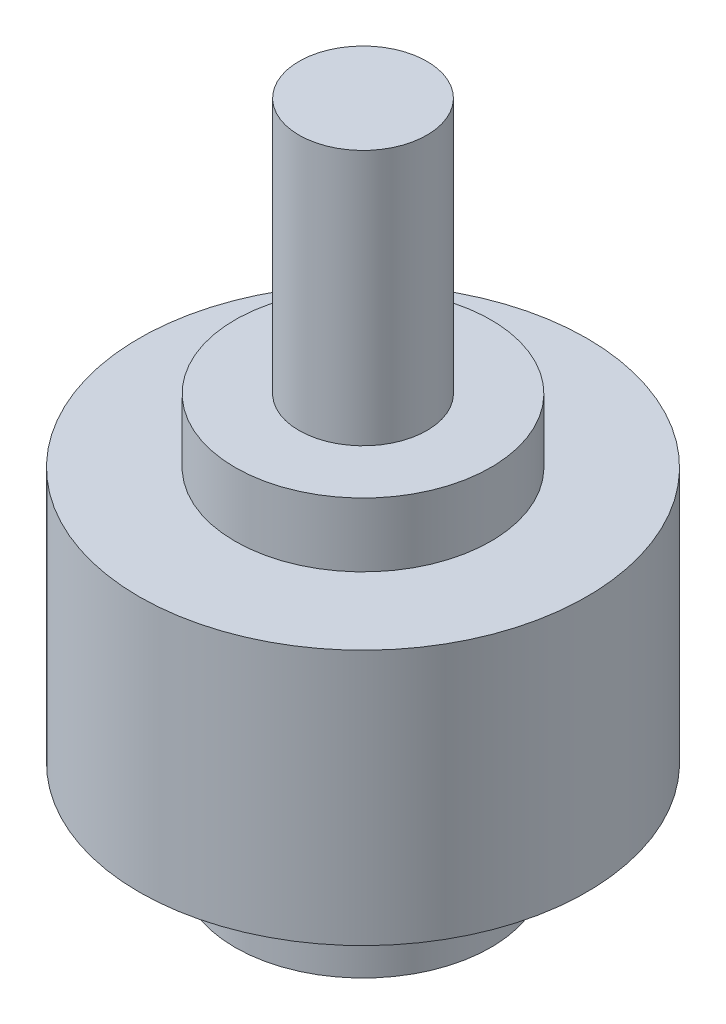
ISO-10303-21;
HEADER;
FILE_DESCRIPTION(('STEP AP214'),'2;1');
FILE_NAME('part.step','',(''),(''),'','','');
FILE_SCHEMA(('AUTOMOTIVE_DESIGN { 1 0 10303 214 1 1 1 1 }'));
ENDSEC;
DATA;
#1=APPLICATION_CONTEXT('core data for automotive mechanical design processes');
#2=APPLICATION_PROTOCOL_DEFINITION('international standard','automotive_design',2000,#1);
#3=PRODUCT_CONTEXT('',#1,'mechanical');
#4=PRODUCT('Part','Part','',(#3));
#5=PRODUCT_RELATED_PRODUCT_CATEGORY('part','',(#4));
#6=PRODUCT_DEFINITION_FORMATION('','',#4);
#7=PRODUCT_DEFINITION_CONTEXT('part definition',#1,'design');
#8=PRODUCT_DEFINITION('design','',#6,#7);
#9=PRODUCT_DEFINITION_SHAPE('','',#8);
#10=(LENGTH_UNIT() NAMED_UNIT(*) SI_UNIT(.MILLI.,.METRE.));
#11=(NAMED_UNIT(*) PLANE_ANGLE_UNIT() SI_UNIT($,.RADIAN.));
#12=(NAMED_UNIT(*) SI_UNIT($,.STERADIAN.) SOLID_ANGLE_UNIT());
#13=UNCERTAINTY_MEASURE_WITH_UNIT(LENGTH_MEASURE(1.E-05),#10,'distance_accuracy_value','');
#14=(GEOMETRIC_REPRESENTATION_CONTEXT(3) GLOBAL_UNCERTAINTY_ASSIGNED_CONTEXT((#13)) GLOBAL_UNIT_ASSIGNED_CONTEXT((#10,
#11,#12)) REPRESENTATION_CONTEXT('',''));
#15=CARTESIAN_POINT('',(0.,0.,0.));
#16=DIRECTION('',(0.,0.,1.));
#17=DIRECTION('',(1.,0.,0.));
#18=AXIS2_PLACEMENT_3D('',#15,#16,#17);
#19=CARTESIAN_POINT('',(12.7,133.35,0.));
#20=DIRECTION('',(0.,-1.,0.));
#21=DIRECTION('',(0.,0.,-1.));
#22=AXIS2_PLACEMENT_3D('',#19,#20,#21);
#23=PLANE('',#22);
#24=CARTESIAN_POINT('',(0.,133.35,0.));
#25=DIRECTION('',(0.,1.,0.));
#26=DIRECTION('',(0.,0.,1.));
#27=AXIS2_PLACEMENT_3D('',#24,#25,#26);
#28=CIRCLE('',#27,12.7);
#29=CARTESIAN_POINT('',(0.,133.35,12.7));
#30=VERTEX_POINT('',#29);
#31=EDGE_CURVE('E10',#30,#30,#28,.T.);
#32=ORIENTED_EDGE('',*,*,#31,.T.);
#33=EDGE_LOOP('',(#32));
#34=FACE_BOUND('',#33,.T.);
#35=ADVANCED_FACE('F30',(#34),#23,.F.);
#36=CARTESIAN_POINT('',(0.,0.,0.));
#37=DIRECTION('',(0.,1.,0.));
#38=DIRECTION('',(0.,0.,1.));
#39=AXIS2_PLACEMENT_3D('',#36,#37,#38);
#40=CYLINDRICAL_SURFACE('',#39,12.7);
#41=ORIENTED_EDGE('',*,*,#31,.F.);
#42=EDGE_LOOP('',(#41));
#43=FACE_BOUND('',#42,.T.);
#44=CARTESIAN_POINT('',(0.,82.55,0.));
#45=DIRECTION('',(0.,1.,0.));
#46=DIRECTION('',(0.,0.,1.));
#47=AXIS2_PLACEMENT_3D('',#44,#45,#46);
#48=CIRCLE('',#47,12.7);
#49=CARTESIAN_POINT('',(0.,82.55,12.7));
#50=VERTEX_POINT('',#49);
#51=EDGE_CURVE('E36',#50,#50,#48,.T.);
#52=ORIENTED_EDGE('',*,*,#51,.T.);
#53=EDGE_LOOP('',(#52));
#54=FACE_BOUND('',#53,.T.);
#55=ADVANCED_FACE('F95',(#43,#54),#40,.T.);
#56=CARTESIAN_POINT('',(25.4,82.55,0.));
#57=DIRECTION('',(0.,-1.,0.));
#58=DIRECTION('',(0.,0.,-1.));
#59=AXIS2_PLACEMENT_3D('',#56,#57,#58);
#60=PLANE('',#59);
#61=ORIENTED_EDGE('',*,*,#51,.F.);
#62=EDGE_LOOP('',(#61));
#63=FACE_BOUND('',#62,.T.);
#64=CARTESIAN_POINT('',(0.,82.55,0.));
#65=DIRECTION('',(0.,1.,0.));
#66=DIRECTION('',(0.,0.,1.));
#67=AXIS2_PLACEMENT_3D('',#64,#65,#66);
#68=CIRCLE('',#67,25.4);
#69=CARTESIAN_POINT('',(0.,82.55,25.4));
#70=VERTEX_POINT('',#69);
#71=EDGE_CURVE('E40',#70,#70,#68,.T.);
#72=ORIENTED_EDGE('',*,*,#71,.T.);
#73=EDGE_LOOP('',(#72));
#74=FACE_BOUND('',#73,.T.);
#75=ADVANCED_FACE('F99',(#63,#74),#60,.F.);
#76=CARTESIAN_POINT('',(0.,0.,0.));
#77=DIRECTION('',(0.,1.,0.));
#78=DIRECTION('',(0.,0.,1.));
#79=AXIS2_PLACEMENT_3D('',#76,#77,#78);
#80=CYLINDRICAL_SURFACE('',#79,25.4);
#81=ORIENTED_EDGE('',*,*,#71,.F.);
#82=EDGE_LOOP('',(#81));
#83=FACE_BOUND('',#82,.T.);
#84=CARTESIAN_POINT('',(0.,69.85,0.));
#85=DIRECTION('',(0.,1.,0.));
#86=DIRECTION('',(0.,0.,1.));
#87=AXIS2_PLACEMENT_3D('',#84,#85,#86);
#88=CIRCLE('',#87,25.4);
#89=CARTESIAN_POINT('',(0.,69.85,25.4));
#90=VERTEX_POINT('',#89);
#91=EDGE_CURVE('E44',#90,#90,#88,.T.);
#92=ORIENTED_EDGE('',*,*,#91,.T.);
#93=EDGE_LOOP('',(#92));
#94=FACE_BOUND('',#93,.T.);
#95=ADVANCED_FACE('F104',(#83,#94),#80,.T.);
#96=CARTESIAN_POINT('',(44.45,69.85,0.));
#97=DIRECTION('',(0.,-1.,0.));
#98=DIRECTION('',(0.,0.,-1.));
#99=AXIS2_PLACEMENT_3D('',#96,#97,#98);
#100=PLANE('',#99);
#101=ORIENTED_EDGE('',*,*,#91,.F.);
#102=EDGE_LOOP('',(#101));
#103=FACE_BOUND('',#102,.T.);
#104=CARTESIAN_POINT('',(0.,69.85,0.));
#105=DIRECTION('',(0.,1.,0.));
#106=DIRECTION('',(0.,0.,1.));
#107=AXIS2_PLACEMENT_3D('',#104,#105,#106);
#108=CIRCLE('',#107,44.45);
#109=CARTESIAN_POINT('',(0.,69.85,44.45));
#110=VERTEX_POINT('',#109);
#111=EDGE_CURVE('E49',#110,#110,#108,.T.);
#112=ORIENTED_EDGE('',*,*,#111,.T.);
#113=EDGE_LOOP('',(#112));
#114=FACE_BOUND('',#113,.T.);
#115=ADVANCED_FACE('F110',(#103,#114),#100,.F.);
#116=CARTESIAN_POINT('',(0.,0.,0.));
#117=DIRECTION('',(0.,1.,0.));
#118=DIRECTION('',(0.,0.,1.));
#119=AXIS2_PLACEMENT_3D('',#116,#117,#118);
#120=CYLINDRICAL_SURFACE('',#119,44.45);
#121=ORIENTED_EDGE('',*,*,#111,.F.);
#122=EDGE_LOOP('',(#121));
#123=FACE_BOUND('',#122,.T.);
#124=CARTESIAN_POINT('',(0.,19.05,0.));
#125=DIRECTION('',(0.,1.,0.));
#126=DIRECTION('',(0.,0.,1.));
#127=AXIS2_PLACEMENT_3D('',#124,#125,#126);
#128=CIRCLE('',#127,44.45);
#129=CARTESIAN_POINT('',(0.,19.05,44.45));
#130=VERTEX_POINT('',#129);
#131=EDGE_CURVE('E52',#130,#130,#128,.T.);
#132=ORIENTED_EDGE('',*,*,#131,.T.);
#133=EDGE_LOOP('',(#132));
#134=FACE_BOUND('',#133,.T.);
#135=ADVANCED_FACE('F90',(#123,#134),#120,.T.);
#136=CARTESIAN_POINT('',(25.4,19.05,0.));
#137=DIRECTION('',(0.,1.,0.));
#138=DIRECTION('',(0.,0.,1.));
#139=AXIS2_PLACEMENT_3D('',#136,#137,#138);
#140=PLANE('',#139);
#141=ORIENTED_EDGE('',*,*,#131,.F.);
#142=EDGE_LOOP('',(#141));
#143=FACE_BOUND('',#142,.T.);
#144=CARTESIAN_POINT('',(0.,19.05,0.));
#145=DIRECTION('',(0.,1.,0.));
#146=DIRECTION('',(0.,0.,1.));
#147=AXIS2_PLACEMENT_3D('',#144,#145,#146);
#148=CIRCLE('',#147,25.4);
#149=CARTESIAN_POINT('',(0.,19.05,25.4));
#150=VERTEX_POINT('',#149);
#151=EDGE_CURVE('E55',#150,#150,#148,.T.);
#152=ORIENTED_EDGE('',*,*,#151,.T.);
#153=EDGE_LOOP('',(#152));
#154=FACE_BOUND('',#153,.T.);
#155=ADVANCED_FACE('F84',(#143,#154),#140,.F.);
#156=CARTESIAN_POINT('',(0.,0.,0.));
#157=DIRECTION('',(0.,1.,0.));
#158=DIRECTION('',(0.,0.,1.));
#159=AXIS2_PLACEMENT_3D('',#156,#157,#158);
#160=CYLINDRICAL_SURFACE('',#159,25.4);
#161=ORIENTED_EDGE('',*,*,#151,.F.);
#162=EDGE_LOOP('',(#161));
#163=FACE_BOUND('',#162,.T.);
#164=CARTESIAN_POINT('',(0.,0.,0.));
#165=DIRECTION('',(0.,1.,0.));
#166=DIRECTION('',(0.,0.,1.));
#167=AXIS2_PLACEMENT_3D('',#164,#165,#166);
#168=CIRCLE('',#167,25.4);
#169=CARTESIAN_POINT('',(0.,0.,25.4));
#170=VERTEX_POINT('',#169);
#171=EDGE_CURVE('E58',#170,#170,#168,.T.);
#172=ORIENTED_EDGE('',*,*,#171,.T.);
#173=EDGE_LOOP('',(#172));
#174=FACE_BOUND('',#173,.T.);
#175=ADVANCED_FACE('F79',(#163,#174),#160,.T.);
#176=CARTESIAN_POINT('',(0.,0.,0.));
#177=DIRECTION('',(0.,1.,0.));
#178=DIRECTION('',(0.,0.,1.));
#179=AXIS2_PLACEMENT_3D('',#176,#177,#178);
#180=PLANE('',#179);
#181=CARTESIAN_POINT('',(0.,0.,0.));
#182=DIRECTION('',(0.,-1.,0.));
#183=DIRECTION('',(0.,0.,-1.));
#184=AXIS2_PLACEMENT_3D('',#181,#182,#183);
#185=CIRCLE('',#184,12.7);
#186=CARTESIAN_POINT('',(0.,0.,-12.7));
#187=VERTEX_POINT('',#186);
#188=EDGE_CURVE('E62',#187,#187,#185,.T.);
#189=ORIENTED_EDGE('',*,*,#188,.F.);
#190=EDGE_LOOP('',(#189));
#191=FACE_BOUND('',#190,.T.);
#192=ORIENTED_EDGE('',*,*,#171,.F.);
#193=EDGE_LOOP('',(#192));
#194=FACE_BOUND('',#193,.T.);
#195=ADVANCED_FACE('F73',(#191,#194),#180,.F.);
#196=CARTESIAN_POINT('',(0.,50.8,0.));
#197=DIRECTION('',(0.,-1.,0.));
#198=DIRECTION('',(0.,0.,-1.));
#199=AXIS2_PLACEMENT_3D('',#196,#197,#198);
#200=CYLINDRICAL_SURFACE('',#199,12.7);
#201=CARTESIAN_POINT('',(0.,50.8,0.));
#202=DIRECTION('',(0.,-1.,0.));
#203=DIRECTION('',(0.,0.,-1.));
#204=AXIS2_PLACEMENT_3D('',#201,#202,#203);
#205=CIRCLE('',#204,12.7);
#206=CARTESIAN_POINT('',(0.,50.8,-12.7));
#207=VERTEX_POINT('',#206);
#208=EDGE_CURVE('E61',#207,#207,#205,.T.);
#209=ORIENTED_EDGE('',*,*,#208,.F.);
#210=EDGE_LOOP('',(#209));
#211=FACE_BOUND('',#210,.T.);
#212=ORIENTED_EDGE('',*,*,#188,.T.);
#213=EDGE_LOOP('',(#212));
#214=FACE_BOUND('',#213,.T.);
#215=ADVANCED_FACE('F70',(#211,#214),#200,.F.);
#216=CARTESIAN_POINT('',(0.,50.8,0.));
#217=DIRECTION('',(0.,-1.,0.));
#218=DIRECTION('',(0.,0.,-1.));
#219=AXIS2_PLACEMENT_3D('',#216,#217,#218);
#220=PLANE('',#219);
#221=ORIENTED_EDGE('',*,*,#208,.T.);
#222=EDGE_LOOP('',(#221));
#223=FACE_BOUND('',#222,.T.);
#224=ADVANCED_FACE('F68',(#223),#220,.T.);
#225=CLOSED_SHELL('',(#35,#55,#75,#95,#115,#135,#155,#175,#195,#215,#224));
#226=MANIFOLD_SOLID_BREP('B2',#225);
#227=ADVANCED_BREP_SHAPE_REPRESENTATION('',(#18,#226),#14);
#228=SHAPE_DEFINITION_REPRESENTATION(#9,#227);
ENDSEC;
END-ISO-10303-21;
